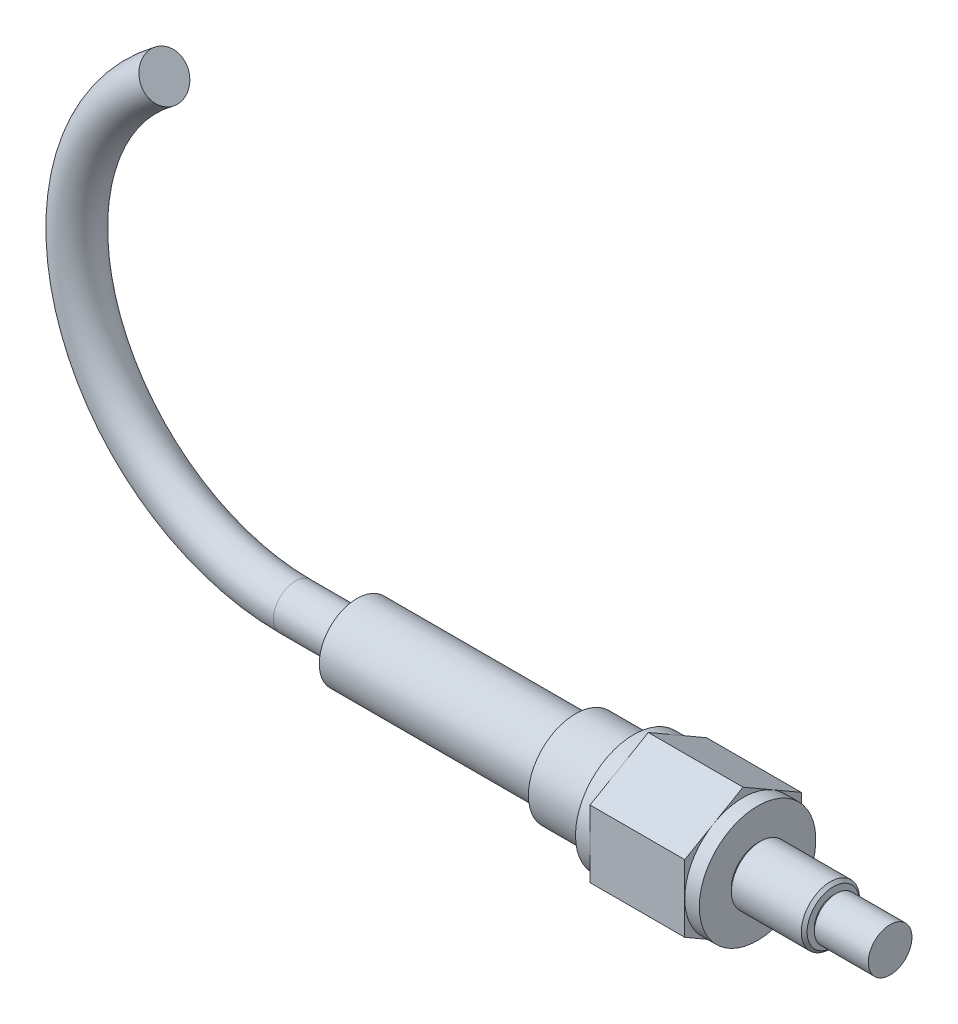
ISO-10303-21;
HEADER;
FILE_DESCRIPTION(('STEP AP214'),'2;1');
FILE_NAME('part.step','',(''),(''),'','','');
FILE_SCHEMA(('AUTOMOTIVE_DESIGN { 1 0 10303 214 1 1 1 1 }'));
ENDSEC;
DATA;
#1=APPLICATION_CONTEXT('core data for automotive mechanical design processes');
#2=APPLICATION_PROTOCOL_DEFINITION('international standard','automotive_design',2000,#1);
#3=PRODUCT_CONTEXT('',#1,'mechanical');
#4=PRODUCT('Part','Part','',(#3));
#5=PRODUCT_RELATED_PRODUCT_CATEGORY('part','',(#4));
#6=PRODUCT_DEFINITION_FORMATION('','',#4);
#7=PRODUCT_DEFINITION_CONTEXT('part definition',#1,'design');
#8=PRODUCT_DEFINITION('design','',#6,#7);
#9=PRODUCT_DEFINITION_SHAPE('','',#8);
#10=(LENGTH_UNIT() NAMED_UNIT(*) SI_UNIT(.MILLI.,.METRE.));
#11=(NAMED_UNIT(*) PLANE_ANGLE_UNIT() SI_UNIT($,.RADIAN.));
#12=(NAMED_UNIT(*) SI_UNIT($,.STERADIAN.) SOLID_ANGLE_UNIT());
#13=UNCERTAINTY_MEASURE_WITH_UNIT(LENGTH_MEASURE(1.E-05),#10,'distance_accuracy_value','');
#14=(GEOMETRIC_REPRESENTATION_CONTEXT(3) GLOBAL_UNCERTAINTY_ASSIGNED_CONTEXT((#13)) GLOBAL_UNIT_ASSIGNED_CONTEXT((#10,
#11,#12)) REPRESENTATION_CONTEXT('',''));
#15=CARTESIAN_POINT('',(0.,0.,0.));
#16=DIRECTION('',(0.,0.,1.));
#17=DIRECTION('',(1.,0.,0.));
#18=AXIS2_PLACEMENT_3D('',#15,#16,#17);
#19=CARTESIAN_POINT('',(-36.6,2.59029712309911,0.));
#20=DIRECTION('',(1.,0.,0.));
#21=DIRECTION('',(0.,0.,-1.));
#22=AXIS2_PLACEMENT_3D('',#19,#20,#21);
#23=PLANE('',#22);
#24=CARTESIAN_POINT('',(-36.6,0.,0.));
#25=DIRECTION('',(-1.,0.,0.));
#26=DIRECTION('',(0.,0.,1.));
#27=AXIS2_PLACEMENT_3D('',#24,#25,#26);
#28=CIRCLE('',#27,2.59029712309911);
#29=CARTESIAN_POINT('',(-36.6,0.,2.59029712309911));
#30=VERTEX_POINT('',#29);
#31=EDGE_CURVE('E68',#30,#30,#28,.T.);
#32=ORIENTED_EDGE('',*,*,#31,.T.);
#33=EDGE_LOOP('',(#32));
#34=FACE_BOUND('',#33,.T.);
#35=CARTESIAN_POINT('',(-36.6,0.,0.));
#36=DIRECTION('',(-1.,0.,0.));
#37=DIRECTION('',(0.,0.,1.));
#38=AXIS2_PLACEMENT_3D('',#35,#36,#37);
#39=CIRCLE('',#38,1.5);
#40=CARTESIAN_POINT('',(-36.6,0.,1.5));
#41=VERTEX_POINT('',#40);
#42=EDGE_CURVE('E11',#41,#41,#39,.T.);
#43=ORIENTED_EDGE('',*,*,#42,.F.);
#44=EDGE_LOOP('',(#43));
#45=FACE_BOUND('',#44,.T.);
#46=ADVANCED_FACE('F46',(#34,#45),#23,.F.);
#47=CARTESIAN_POINT('',(-16.6,0.,0.));
#48=DIRECTION('',(-1.,0.,0.));
#49=DIRECTION('',(0.,0.,1.));
#50=AXIS2_PLACEMENT_3D('',#47,#48,#49);
#51=PLANE('',#50);
#52=CARTESIAN_POINT('',(-16.6,0.,0.));
#53=DIRECTION('',(-1.,0.,0.));
#54=DIRECTION('',(0.,0.,1.));
#55=AXIS2_PLACEMENT_3D('',#52,#53,#54);
#56=CIRCLE('',#55,4.);
#57=CARTESIAN_POINT('',(-16.6,0.,4.));
#58=VERTEX_POINT('',#57);
#59=EDGE_CURVE('E50',#58,#58,#56,.T.);
#60=ORIENTED_EDGE('',*,*,#59,.F.);
#61=EDGE_LOOP('',(#60));
#62=FACE_BOUND('',#61,.T.);
#63=ADVANCED_FACE('F48',(#62),#51,.F.);
#64=CARTESIAN_POINT('',(0.,0.,0.));
#65=DIRECTION('',(-1.,0.,0.));
#66=DIRECTION('',(0.,0.,1.));
#67=AXIS2_PLACEMENT_3D('',#64,#65,#66);
#68=CYLINDRICAL_SURFACE('',#67,4.);
#69=CARTESIAN_POINT('',(-17.6,0.,0.));
#70=DIRECTION('',(-1.,0.,0.));
#71=DIRECTION('',(0.,0.,1.));
#72=AXIS2_PLACEMENT_3D('',#69,#70,#71);
#73=CIRCLE('',#72,4.);
#74=CARTESIAN_POINT('',(-17.6,0.,4.));
#75=VERTEX_POINT('',#74);
#76=EDGE_CURVE('E61',#75,#75,#73,.T.);
#77=ORIENTED_EDGE('',*,*,#76,.F.);
#78=EDGE_LOOP('',(#77));
#79=FACE_BOUND('',#78,.T.);
#80=ORIENTED_EDGE('',*,*,#59,.T.);
#81=EDGE_LOOP('',(#80));
#82=FACE_BOUND('',#81,.T.);
#83=ADVANCED_FACE('F89',(#79,#82),#68,.T.);
#84=CARTESIAN_POINT('',(-17.6,4.,0.));
#85=DIRECTION('',(1.,0.,0.));
#86=DIRECTION('',(0.,0.,-1.));
#87=AXIS2_PLACEMENT_3D('',#84,#85,#86);
#88=PLANE('',#87);
#89=CARTESIAN_POINT('',(-17.6,0.,0.));
#90=DIRECTION('',(-1.,0.,0.));
#91=DIRECTION('',(0.,0.,1.));
#92=AXIS2_PLACEMENT_3D('',#89,#90,#91);
#93=CIRCLE('',#92,3.23454467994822);
#94=CARTESIAN_POINT('',(-17.6,0.,3.23454467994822));
#95=VERTEX_POINT('',#94);
#96=EDGE_CURVE('E80',#95,#95,#93,.T.);
#97=ORIENTED_EDGE('',*,*,#96,.F.);
#98=EDGE_LOOP('',(#97));
#99=FACE_BOUND('',#98,.T.);
#100=ORIENTED_EDGE('',*,*,#76,.T.);
#101=EDGE_LOOP('',(#100));
#102=FACE_BOUND('',#101,.T.);
#103=ADVANCED_FACE('F87',(#99,#102),#88,.F.);
#104=CARTESIAN_POINT('',(0.,0.,0.));
#105=DIRECTION('',(-1.,0.,0.));
#106=DIRECTION('',(0.,0.,1.));
#107=AXIS2_PLACEMENT_3D('',#104,#105,#106);
#108=CYLINDRICAL_SURFACE('',#107,3.23454467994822);
#109=CARTESIAN_POINT('',(-21.6,0.,0.));
#110=DIRECTION('',(-1.,0.,0.));
#111=DIRECTION('',(0.,0.,1.));
#112=AXIS2_PLACEMENT_3D('',#109,#110,#111);
#113=CIRCLE('',#112,3.23454467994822);
#114=CARTESIAN_POINT('',(-21.6,0.,3.23454467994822));
#115=VERTEX_POINT('',#114);
#116=EDGE_CURVE('E76',#115,#115,#113,.T.);
#117=ORIENTED_EDGE('',*,*,#116,.F.);
#118=EDGE_LOOP('',(#117));
#119=FACE_BOUND('',#118,.T.);
#120=ORIENTED_EDGE('',*,*,#96,.T.);
#121=EDGE_LOOP('',(#120));
#122=FACE_BOUND('',#121,.T.);
#123=ADVANCED_FACE('F114',(#119,#122),#108,.T.);
#124=CARTESIAN_POINT('',(-21.6,3.23454467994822,0.));
#125=DIRECTION('',(1.,0.,0.));
#126=DIRECTION('',(0.,0.,-1.));
#127=AXIS2_PLACEMENT_3D('',#124,#125,#126);
#128=PLANE('',#127);
#129=CARTESIAN_POINT('',(-21.6,0.,0.));
#130=DIRECTION('',(-1.,0.,0.));
#131=DIRECTION('',(0.,0.,1.));
#132=AXIS2_PLACEMENT_3D('',#129,#130,#131);
#133=CIRCLE('',#132,2.59029712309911);
#134=CARTESIAN_POINT('',(-21.6,0.,2.59029712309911));
#135=VERTEX_POINT('',#134);
#136=EDGE_CURVE('E72',#135,#135,#133,.T.);
#137=ORIENTED_EDGE('',*,*,#136,.F.);
#138=EDGE_LOOP('',(#137));
#139=FACE_BOUND('',#138,.T.);
#140=ORIENTED_EDGE('',*,*,#116,.T.);
#141=EDGE_LOOP('',(#140));
#142=FACE_BOUND('',#141,.T.);
#143=ADVANCED_FACE('F110',(#139,#142),#128,.F.);
#144=CARTESIAN_POINT('',(0.,0.,0.));
#145=DIRECTION('',(-1.,0.,0.));
#146=DIRECTION('',(0.,0.,1.));
#147=AXIS2_PLACEMENT_3D('',#144,#145,#146);
#148=CYLINDRICAL_SURFACE('',#147,2.59029712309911);
#149=ORIENTED_EDGE('',*,*,#31,.F.);
#150=EDGE_LOOP('',(#149));
#151=FACE_BOUND('',#150,.T.);
#152=ORIENTED_EDGE('',*,*,#136,.T.);
#153=EDGE_LOOP('',(#152));
#154=FACE_BOUND('',#153,.T.);
#155=ADVANCED_FACE('F107',(#151,#154),#148,.T.);
#156=CARTESIAN_POINT('',(-40.838108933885,15.,0.));
#157=DIRECTION('',(0.,0.,-1.));
#158=DIRECTION('',(-1.,0.,0.));
#159=AXIS2_PLACEMENT_3D('',#156,#157,#158);
#160=TOROIDAL_SURFACE('',#159,15.,1.5);
#161=CARTESIAN_POINT('',(-40.838108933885,0.,0.));
#162=DIRECTION('',(-1.,0.,0.));
#163=DIRECTION('',(0.,0.,1.));
#164=AXIS2_PLACEMENT_3D('',#161,#162,#163);
#165=CIRCLE('',#164,1.5);
#166=CARTESIAN_POINT('',(-40.838108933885,-1.5,0.));
#167=VERTEX_POINT('',#166);
#168=EDGE_CURVE('E64',#167,#167,#165,.T.);
#169=CARTESIAN_POINT('',(-49.8226714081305,27.0115626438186,0.));
#170=DIRECTION('',(0.800770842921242,0.598970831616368,0.));
#171=DIRECTION('',(0.,0.,1.));
#172=AXIS2_PLACEMENT_3D('',#169,#170,#171);
#173=CIRCLE('',#172,1.5);
#174=CARTESIAN_POINT('',(-50.7211276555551,28.2127189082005,0.));
#175=VERTEX_POINT('',#174);
#176=EDGE_CURVE('E65',#175,#175,#173,.T.);
#177=CARTESIAN_POINT('',(-40.838108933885,15.,0.));
#178=DIRECTION('',(0.,0.,-1.));
#179=DIRECTION('',(-1.,0.,0.));
#180=AXIS2_PLACEMENT_3D('',#177,#178,#179);
#181=CIRCLE('',#180,16.5);
#182=EDGE_CURVE('',#167,#175,#181,.T.);
#183=ORIENTED_EDGE('',*,*,#168,.T.);
#184=ORIENTED_EDGE('',*,*,#176,.F.);
#185=ORIENTED_EDGE('',*,*,#182,.T.);
#186=ORIENTED_EDGE('',*,*,#182,.F.);
#187=EDGE_LOOP('',(#183,#185,#184,#186));
#188=FACE_BOUND('',#187,.T.);
#189=ADVANCED_FACE('F105',(#188),#160,.T.);
#190=CARTESIAN_POINT('',(-40.838108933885,0.,0.));
#191=DIRECTION('',(1.,0.,0.));
#192=DIRECTION('',(0.,0.,-1.));
#193=AXIS2_PLACEMENT_3D('',#190,#191,#192);
#194=CYLINDRICAL_SURFACE('',#193,1.5);
#195=ORIENTED_EDGE('',*,*,#168,.F.);
#196=EDGE_LOOP('',(#195));
#197=FACE_BOUND('',#196,.T.);
#198=ORIENTED_EDGE('',*,*,#42,.T.);
#199=EDGE_LOOP('',(#198));
#200=FACE_BOUND('',#199,.T.);
#201=ADVANCED_FACE('F141',(#197,#200),#194,.T.);
#202=CARTESIAN_POINT('',(-49.8226714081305,27.0115626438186,0.));
#203=DIRECTION('',(0.800770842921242,0.598970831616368,0.));
#204=DIRECTION('',(0.,0.,1.));
#205=AXIS2_PLACEMENT_3D('',#202,#203,#204);
#206=PLANE('',#205);
#207=ORIENTED_EDGE('',*,*,#176,.T.);
#208=EDGE_LOOP('',(#207));
#209=FACE_BOUND('',#208,.T.);
#210=ADVANCED_FACE('F147',(#209),#206,.T.);
#211=CLOSED_SHELL('',(#46,#63,#83,#103,#123,#143,#155,#189,#201,#210));
#212=MANIFOLD_SOLID_BREP('B2',#211);
#213=CARTESIAN_POINT('',(0.,0.,0.));
#214=DIRECTION('',(-1.,0.,0.));
#215=DIRECTION('',(0.,0.,1.));
#216=AXIS2_PLACEMENT_3D('',#213,#214,#215);
#217=PLANE('',#216);
#218=CARTESIAN_POINT('',(0.,0.,0.));
#219=DIRECTION('',(-1.,0.,0.));
#220=DIRECTION('',(0.,0.,1.));
#221=AXIS2_PLACEMENT_3D('',#218,#219,#220);
#222=CIRCLE('',#221,1.5);
#223=CARTESIAN_POINT('',(0.,0.,1.5));
#224=VERTEX_POINT('',#223);
#225=EDGE_CURVE('E44',#224,#224,#222,.T.);
#226=ORIENTED_EDGE('',*,*,#225,.F.);
#227=EDGE_LOOP('',(#226));
#228=FACE_BOUND('',#227,.T.);
#229=ADVANCED_FACE('F210',(#228),#217,.F.);
#230=CARTESIAN_POINT('',(0.,0.,0.));
#231=DIRECTION('',(-1.,0.,0.));
#232=DIRECTION('',(0.,0.,1.));
#233=AXIS2_PLACEMENT_3D('',#230,#231,#232);
#234=CYLINDRICAL_SURFACE('',#233,1.5);
#235=CARTESIAN_POINT('',(-3.7,0.,0.));
#236=DIRECTION('',(-1.,0.,0.));
#237=DIRECTION('',(0.,0.,1.));
#238=AXIS2_PLACEMENT_3D('',#235,#236,#237);
#239=CIRCLE('',#238,1.5);
#240=CARTESIAN_POINT('',(-3.7,0.,1.5));
#241=VERTEX_POINT('',#240);
#242=EDGE_CURVE('E218',#241,#241,#239,.T.);
#243=ORIENTED_EDGE('',*,*,#242,.F.);
#244=EDGE_LOOP('',(#243));
#245=FACE_BOUND('',#244,.T.);
#246=ORIENTED_EDGE('',*,*,#225,.T.);
#247=EDGE_LOOP('',(#246));
#248=FACE_BOUND('',#247,.T.);
#249=ADVANCED_FACE('F391',(#245,#248),#234,.T.);
#250=CARTESIAN_POINT('',(-3.7,1.5,0.));
#251=DIRECTION('',(1.,0.,0.));
#252=DIRECTION('',(0.,0.,-1.));
#253=AXIS2_PLACEMENT_3D('',#250,#251,#252);
#254=PLANE('',#253);
#255=CARTESIAN_POINT('',(-3.7,0.,0.));
#256=DIRECTION('',(-1.,0.,0.));
#257=DIRECTION('',(0.,0.,1.));
#258=AXIS2_PLACEMENT_3D('',#255,#256,#257);
#259=CIRCLE('',#258,1.3);
#260=CARTESIAN_POINT('',(-3.7,0.,1.3));
#261=VERTEX_POINT('',#260);
#262=EDGE_CURVE('E382',#261,#261,#259,.T.);
#263=ORIENTED_EDGE('',*,*,#262,.F.);
#264=EDGE_LOOP('',(#263));
#265=FACE_BOUND('',#264,.T.);
#266=ORIENTED_EDGE('',*,*,#242,.T.);
#267=EDGE_LOOP('',(#266));
#268=FACE_BOUND('',#267,.T.);
#269=ADVANCED_FACE('F389',(#265,#268),#254,.F.);
#270=CARTESIAN_POINT('',(0.,0.,0.));
#271=DIRECTION('',(-1.,0.,0.));
#272=DIRECTION('',(0.,0.,1.));
#273=AXIS2_PLACEMENT_3D('',#270,#271,#272);
#274=CYLINDRICAL_SURFACE('',#273,1.3);
#275=CARTESIAN_POINT('',(-3.9,0.,0.));
#276=DIRECTION('',(-1.,0.,0.));
#277=DIRECTION('',(0.,0.,1.));
#278=AXIS2_PLACEMENT_3D('',#275,#276,#277);
#279=CIRCLE('',#278,1.3);
#280=CARTESIAN_POINT('',(-3.9,0.,1.3));
#281=VERTEX_POINT('',#280);
#282=EDGE_CURVE('E378',#281,#281,#279,.T.);
#283=ORIENTED_EDGE('',*,*,#282,.F.);
#284=EDGE_LOOP('',(#283));
#285=FACE_BOUND('',#284,.T.);
#286=ORIENTED_EDGE('',*,*,#262,.T.);
#287=EDGE_LOOP('',(#286));
#288=FACE_BOUND('',#287,.T.);
#289=ADVANCED_FACE('F407',(#285,#288),#274,.T.);
#290=CARTESIAN_POINT('',(-3.9,1.3,0.));
#291=DIRECTION('',(-1.,0.,0.));
#292=DIRECTION('',(0.,0.,1.));
#293=AXIS2_PLACEMENT_3D('',#290,#291,#292);
#294=PLANE('',#293);
#295=CARTESIAN_POINT('',(-3.9,0.,0.));
#296=DIRECTION('',(-1.,0.,0.));
#297=DIRECTION('',(0.,0.,1.));
#298=AXIS2_PLACEMENT_3D('',#295,#296,#297);
#299=CIRCLE('',#298,1.8);
#300=CARTESIAN_POINT('',(-3.9,0.,1.8));
#301=VERTEX_POINT('',#300);
#302=EDGE_CURVE('E374',#301,#301,#299,.T.);
#303=ORIENTED_EDGE('',*,*,#302,.F.);
#304=EDGE_LOOP('',(#303));
#305=FACE_BOUND('',#304,.T.);
#306=ORIENTED_EDGE('',*,*,#282,.T.);
#307=EDGE_LOOP('',(#306));
#308=FACE_BOUND('',#307,.T.);
#309=ADVANCED_FACE('F414',(#305,#308),#294,.F.);
#310=CARTESIAN_POINT('',(-3.9,0.,0.));
#311=DIRECTION('',(-1.,0.,0.));
#312=DIRECTION('',(0.,0.,1.));
#313=AXIS2_PLACEMENT_3D('',#310,#311,#312);
#314=CONICAL_SURFACE('',#313,1.8,0.785398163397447);
#315=CARTESIAN_POINT('',(-4.1,0.,0.));
#316=DIRECTION('',(-1.,0.,0.));
#317=DIRECTION('',(0.,0.,1.));
#318=AXIS2_PLACEMENT_3D('',#315,#316,#317);
#319=CIRCLE('',#318,2.);
#320=CARTESIAN_POINT('',(-4.1,0.,2.));
#321=VERTEX_POINT('',#320);
#322=EDGE_CURVE('E370',#321,#321,#319,.T.);
#323=ORIENTED_EDGE('',*,*,#322,.F.);
#324=EDGE_LOOP('',(#323));
#325=FACE_BOUND('',#324,.T.);
#326=ORIENTED_EDGE('',*,*,#302,.T.);
#327=EDGE_LOOP('',(#326));
#328=FACE_BOUND('',#327,.T.);
#329=ADVANCED_FACE('F421',(#325,#328),#314,.T.);
#330=CARTESIAN_POINT('',(0.,0.,0.));
#331=DIRECTION('',(-1.,0.,0.));
#332=DIRECTION('',(0.,0.,1.));
#333=AXIS2_PLACEMENT_3D('',#330,#331,#332);
#334=CYLINDRICAL_SURFACE('',#333,2.);
#335=CARTESIAN_POINT('',(-8.9,0.,0.));
#336=DIRECTION('',(-1.,0.,0.));
#337=DIRECTION('',(0.,0.,1.));
#338=AXIS2_PLACEMENT_3D('',#335,#336,#337);
#339=CIRCLE('',#338,2.);
#340=CARTESIAN_POINT('',(-8.9,0.,2.));
#341=VERTEX_POINT('',#340);
#342=EDGE_CURVE('E366',#341,#341,#339,.T.);
#343=ORIENTED_EDGE('',*,*,#342,.F.);
#344=EDGE_LOOP('',(#343));
#345=FACE_BOUND('',#344,.T.);
#346=ORIENTED_EDGE('',*,*,#322,.T.);
#347=EDGE_LOOP('',(#346));
#348=FACE_BOUND('',#347,.T.);
#349=ADVANCED_FACE('F428',(#345,#348),#334,.T.);
#350=CARTESIAN_POINT('',(-8.9,0.,0.));
#351=DIRECTION('',(1.,0.,0.));
#352=DIRECTION('',(0.,0.,-1.));
#353=AXIS2_PLACEMENT_3D('',#350,#351,#352);
#354=CONICAL_SURFACE('',#353,2.,0.785398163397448);
#355=CARTESIAN_POINT('',(-9.1,0.,0.));
#356=DIRECTION('',(-1.,0.,0.));
#357=DIRECTION('',(0.,0.,1.));
#358=AXIS2_PLACEMENT_3D('',#355,#356,#357);
#359=CIRCLE('',#358,1.8);
#360=CARTESIAN_POINT('',(-9.1,0.,1.8));
#361=VERTEX_POINT('',#360);
#362=EDGE_CURVE('E362',#361,#361,#359,.T.);
#363=ORIENTED_EDGE('',*,*,#362,.F.);
#364=EDGE_LOOP('',(#363));
#365=FACE_BOUND('',#364,.T.);
#366=ORIENTED_EDGE('',*,*,#342,.T.);
#367=EDGE_LOOP('',(#366));
#368=FACE_BOUND('',#367,.T.);
#369=ADVANCED_FACE('F435',(#365,#368),#354,.T.);
#370=CARTESIAN_POINT('',(-9.1,1.8,0.));
#371=DIRECTION('',(-1.,0.,0.));
#372=DIRECTION('',(0.,0.,1.));
#373=AXIS2_PLACEMENT_3D('',#370,#371,#372);
#374=PLANE('',#373);
#375=CARTESIAN_POINT('',(-9.1,0.,0.));
#376=DIRECTION('',(-1.,0.,0.));
#377=DIRECTION('',(0.,0.,1.));
#378=AXIS2_PLACEMENT_3D('',#375,#376,#377);
#379=CIRCLE('',#378,4.);
#380=CARTESIAN_POINT('',(-9.1,0.,4.));
#381=VERTEX_POINT('',#380);
#382=EDGE_CURVE('E357',#381,#381,#379,.T.);
#383=ORIENTED_EDGE('',*,*,#382,.F.);
#384=EDGE_LOOP('',(#383));
#385=FACE_BOUND('',#384,.T.);
#386=ORIENTED_EDGE('',*,*,#362,.T.);
#387=EDGE_LOOP('',(#386));
#388=FACE_BOUND('',#387,.T.);
#389=ADVANCED_FACE('F442',(#385,#388),#374,.F.);
#390=CARTESIAN_POINT('',(0.,0.,0.));
#391=DIRECTION('',(-1.,0.,0.));
#392=DIRECTION('',(0.,0.,1.));
#393=AXIS2_PLACEMENT_3D('',#390,#391,#392);
#394=CYLINDRICAL_SURFACE('',#393,4.);
#395=CARTESIAN_POINT('',(-10.1,0.,0.));
#396=DIRECTION('',(-1.,0.,0.));
#397=DIRECTION('',(0.,0.,1.));
#398=AXIS2_PLACEMENT_3D('',#395,#396,#397);
#399=CIRCLE('',#398,4.);
#400=CARTESIAN_POINT('',(-10.1,0.,4.));
#401=VERTEX_POINT('',#400);
#402=CARTESIAN_POINT('',(-10.1,3.46410161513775,2.));
#403=VERTEX_POINT('',#402);
#404=EDGE_CURVE('E316',#401,#403,#399,.T.);
#405=ORIENTED_EDGE('',*,*,#404,.F.);
#406=CARTESIAN_POINT('',(-10.1,-3.46410161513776,2.));
#407=VERTEX_POINT('',#406);
#408=EDGE_CURVE('E225',#407,#401,#399,.T.);
#409=ORIENTED_EDGE('',*,*,#408,.F.);
#410=CARTESIAN_POINT('',(-10.1,-3.46410161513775,-2.));
#411=VERTEX_POINT('',#410);
#412=EDGE_CURVE('E229',#411,#407,#399,.T.);
#413=ORIENTED_EDGE('',*,*,#412,.F.);
#414=CARTESIAN_POINT('',(-10.1,0.,-4.));
#415=VERTEX_POINT('',#414);
#416=EDGE_CURVE('E652',#415,#411,#399,.T.);
#417=ORIENTED_EDGE('',*,*,#416,.F.);
#418=CARTESIAN_POINT('',(-10.1,3.46410161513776,-2.));
#419=VERTEX_POINT('',#418);
#420=EDGE_CURVE('E649',#419,#415,#399,.T.);
#421=ORIENTED_EDGE('',*,*,#420,.F.);
#422=EDGE_CURVE('E358',#403,#419,#399,.T.);
#423=ORIENTED_EDGE('',*,*,#422,.F.);
#424=EDGE_LOOP('',(#405,#409,#413,#417,#421,#423));
#425=FACE_BOUND('',#424,.T.);
#426=ORIENTED_EDGE('',*,*,#382,.T.);
#427=EDGE_LOOP('',(#426));
#428=FACE_BOUND('',#427,.T.);
#429=ADVANCED_FACE('F449',(#425,#428),#394,.T.);
#430=CARTESIAN_POINT('',(-10.1,0.,0.));
#431=DIRECTION('',(-1.,0.,0.));
#432=DIRECTION('',(0.,0.,1.));
#433=AXIS2_PLACEMENT_3D('',#430,#431,#432);
#434=PLANE('',#433);
#435=DIRECTION('',(0.,1.,0.));
#436=VECTOR('',#435,1.);
#437=CARTESIAN_POINT('',(-10.1,-2.3094010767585,4.));
#438=LINE('',#437,#436);
#439=CARTESIAN_POINT('',(-10.1,2.3094010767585,4.));
#440=VERTEX_POINT('',#439);
#441=EDGE_CURVE('E292',#401,#440,#438,.T.);
#442=ORIENTED_EDGE('',*,*,#441,.F.);
#443=ORIENTED_EDGE('',*,*,#404,.T.);
#444=DIRECTION('',(0.,0.5,-0.866025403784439));
#445=VECTOR('',#444,1.);
#446=CARTESIAN_POINT('',(-10.1,2.3094010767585,4.));
#447=LINE('',#446,#445);
#448=EDGE_CURVE('E321',#440,#403,#447,.T.);
#449=ORIENTED_EDGE('',*,*,#448,.F.);
#450=EDGE_LOOP('',(#442,#443,#449));
#451=FACE_BOUND('',#450,.T.);
#452=ADVANCED_FACE('F456',(#451),#434,.F.);
#453=CARTESIAN_POINT('',(-10.1,4.61880215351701,0.));
#454=VERTEX_POINT('',#453);
#455=EDGE_CURVE('E353',#403,#454,#447,.T.);
#456=ORIENTED_EDGE('',*,*,#455,.F.);
#457=ORIENTED_EDGE('',*,*,#422,.T.);
#458=DIRECTION('',(0.,-0.5,-0.866025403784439));
#459=VECTOR('',#458,1.);
#460=CARTESIAN_POINT('',(-10.1,4.61880215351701,0.));
#461=LINE('',#460,#459);
#462=EDGE_CURVE('E342',#454,#419,#461,.T.);
#463=ORIENTED_EDGE('',*,*,#462,.F.);
#464=EDGE_LOOP('',(#456,#457,#463));
#465=FACE_BOUND('',#464,.T.);
#466=ADVANCED_FACE('F462',(#465),#434,.F.);
#467=CARTESIAN_POINT('',(-10.1,2.3094010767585,-4.));
#468=VERTEX_POINT('',#467);
#469=EDGE_CURVE('E336',#419,#468,#461,.T.);
#470=ORIENTED_EDGE('',*,*,#469,.F.);
#471=ORIENTED_EDGE('',*,*,#420,.T.);
#472=DIRECTION('',(0.,-1.,0.));
#473=VECTOR('',#472,1.);
#474=CARTESIAN_POINT('',(-10.1,2.3094010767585,-4.));
#475=LINE('',#474,#473);
#476=EDGE_CURVE('E348',#468,#415,#475,.T.);
#477=ORIENTED_EDGE('',*,*,#476,.F.);
#478=EDGE_LOOP('',(#470,#471,#477));
#479=FACE_BOUND('',#478,.T.);
#480=ADVANCED_FACE('F470',(#479),#434,.F.);
#481=CARTESIAN_POINT('',(-10.1,-2.3094010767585,-4.));
#482=VERTEX_POINT('',#481);
#483=EDGE_CURVE('E341',#415,#482,#475,.T.);
#484=ORIENTED_EDGE('',*,*,#483,.F.);
#485=ORIENTED_EDGE('',*,*,#416,.T.);
#486=DIRECTION('',(0.,-0.5,0.866025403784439));
#487=VECTOR('',#486,1.);
#488=CARTESIAN_POINT('',(-10.1,-2.3094010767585,-4.));
#489=LINE('',#488,#487);
#490=EDGE_CURVE('E350',#482,#411,#489,.T.);
#491=ORIENTED_EDGE('',*,*,#490,.F.);
#492=EDGE_LOOP('',(#484,#485,#491));
#493=FACE_BOUND('',#492,.T.);
#494=ADVANCED_FACE('F476',(#493),#434,.F.);
#495=CARTESIAN_POINT('',(-10.1,-4.61880215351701,0.));
#496=VERTEX_POINT('',#495);
#497=EDGE_CURVE('E347',#411,#496,#489,.T.);
#498=ORIENTED_EDGE('',*,*,#497,.F.);
#499=ORIENTED_EDGE('',*,*,#412,.T.);
#500=DIRECTION('',(0.,0.5,0.866025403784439));
#501=VECTOR('',#500,1.);
#502=CARTESIAN_POINT('',(-10.1,-4.61880215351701,0.));
#503=LINE('',#502,#501);
#504=EDGE_CURVE('E293',#496,#407,#503,.T.);
#505=ORIENTED_EDGE('',*,*,#504,.F.);
#506=EDGE_LOOP('',(#498,#499,#505));
#507=FACE_BOUND('',#506,.T.);
#508=ADVANCED_FACE('F482',(#507),#434,.F.);
#509=CARTESIAN_POINT('',(-10.1,-2.3094010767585,4.));
#510=VERTEX_POINT('',#509);
#511=EDGE_CURVE('E287',#407,#510,#503,.T.);
#512=ORIENTED_EDGE('',*,*,#511,.F.);
#513=ORIENTED_EDGE('',*,*,#408,.T.);
#514=EDGE_CURVE('E305',#510,#401,#438,.T.);
#515=ORIENTED_EDGE('',*,*,#514,.F.);
#516=EDGE_LOOP('',(#512,#513,#515));
#517=FACE_BOUND('',#516,.T.);
#518=ADVANCED_FACE('F465',(#517),#434,.F.);
#519=CARTESIAN_POINT('',(-28.8202018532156,2.3094010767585,4.));
#520=DIRECTION('',(0.,-0.866025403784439,-0.5));
#521=DIRECTION('',(0.,0.5,-0.866025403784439));
#522=AXIS2_PLACEMENT_3D('',#519,#520,#521);
#523=PLANE('',#522);
#524=DIRECTION('',(0.,0.5,-0.866025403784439));
#525=VECTOR('',#524,1.);
#526=CARTESIAN_POINT('',(-16.6,2.3094010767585,4.));
#527=LINE('',#526,#525);
#528=CARTESIAN_POINT('',(-16.6,2.3094010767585,4.));
#529=VERTEX_POINT('',#528);
#530=CARTESIAN_POINT('',(-16.6,4.61880215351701,0.));
#531=VERTEX_POINT('',#530);
#532=EDGE_CURVE('E304',#529,#531,#527,.T.);
#533=ORIENTED_EDGE('',*,*,#532,.F.);
#534=DIRECTION('',(1.,0.,0.));
#535=VECTOR('',#534,1.);
#536=CARTESIAN_POINT('',(-28.8202018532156,2.3094010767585,4.));
#537=LINE('',#536,#535);
#538=EDGE_CURVE('E299',#529,#440,#537,.T.);
#539=ORIENTED_EDGE('',*,*,#538,.T.);
#540=ORIENTED_EDGE('',*,*,#448,.T.);
#541=ORIENTED_EDGE('',*,*,#455,.T.);
#542=DIRECTION('',(1.,0.,0.));
#543=VECTOR('',#542,1.);
#544=CARTESIAN_POINT('',(-28.8202018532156,4.61880215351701,0.));
#545=LINE('',#544,#543);
#546=EDGE_CURVE('E332',#531,#454,#545,.T.);
#547=ORIENTED_EDGE('',*,*,#546,.F.);
#548=EDGE_LOOP('',(#533,#539,#540,#541,#547));
#549=FACE_BOUND('',#548,.T.);
#550=ADVANCED_FACE('F493',(#549),#523,.F.);
#551=CARTESIAN_POINT('',(-28.8202018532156,4.61880215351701,0.));
#552=DIRECTION('',(0.,-0.866025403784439,0.5));
#553=DIRECTION('',(0.,-0.5,-0.866025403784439));
#554=AXIS2_PLACEMENT_3D('',#551,#552,#553);
#555=PLANE('',#554);
#556=DIRECTION('',(0.,-0.5,-0.866025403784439));
#557=VECTOR('',#556,1.);
#558=CARTESIAN_POINT('',(-16.6,4.61880215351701,0.));
#559=LINE('',#558,#557);
#560=CARTESIAN_POINT('',(-16.6,2.3094010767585,-4.));
#561=VERTEX_POINT('',#560);
#562=EDGE_CURVE('E326',#531,#561,#559,.T.);
#563=ORIENTED_EDGE('',*,*,#562,.F.);
#564=ORIENTED_EDGE('',*,*,#546,.T.);
#565=ORIENTED_EDGE('',*,*,#462,.T.);
#566=ORIENTED_EDGE('',*,*,#469,.T.);
#567=DIRECTION('',(1.,0.,0.));
#568=VECTOR('',#567,1.);
#569=CARTESIAN_POINT('',(-28.8202018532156,2.3094010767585,-4.));
#570=LINE('',#569,#568);
#571=EDGE_CURVE('E337',#561,#468,#570,.T.);
#572=ORIENTED_EDGE('',*,*,#571,.F.);
#573=EDGE_LOOP('',(#563,#564,#565,#566,#572));
#574=FACE_BOUND('',#573,.T.);
#575=ADVANCED_FACE('F499',(#574),#555,.F.);
#576=CARTESIAN_POINT('',(-28.8202018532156,2.3094010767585,-4.));
#577=DIRECTION('',(0.,0.,1.));
#578=DIRECTION('',(0.,-1.,0.));
#579=AXIS2_PLACEMENT_3D('',#576,#577,#578);
#580=PLANE('',#579);
#581=DIRECTION('',(0.,-1.,0.));
#582=VECTOR('',#581,1.);
#583=CARTESIAN_POINT('',(-16.6,2.3094010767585,-4.));
#584=LINE('',#583,#582);
#585=CARTESIAN_POINT('',(-16.6,-2.3094010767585,-4.));
#586=VERTEX_POINT('',#585);
#587=EDGE_CURVE('E318',#561,#586,#584,.T.);
#588=ORIENTED_EDGE('',*,*,#587,.F.);
#589=ORIENTED_EDGE('',*,*,#571,.T.);
#590=ORIENTED_EDGE('',*,*,#476,.T.);
#591=ORIENTED_EDGE('',*,*,#483,.T.);
#592=DIRECTION('',(1.,0.,0.));
#593=VECTOR('',#592,1.);
#594=CARTESIAN_POINT('',(-28.8202018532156,-2.3094010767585,-4.));
#595=LINE('',#594,#593);
#596=EDGE_CURVE('E343',#586,#482,#595,.T.);
#597=ORIENTED_EDGE('',*,*,#596,.F.);
#598=EDGE_LOOP('',(#588,#589,#590,#591,#597));
#599=FACE_BOUND('',#598,.T.);
#600=ADVANCED_FACE('F506',(#599),#580,.F.);
#601=CARTESIAN_POINT('',(-28.8202018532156,-2.3094010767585,-4.));
#602=DIRECTION('',(0.,0.866025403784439,0.5));
#603=DIRECTION('',(0.,-0.5,0.866025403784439));
#604=AXIS2_PLACEMENT_3D('',#601,#602,#603);
#605=PLANE('',#604);
#606=DIRECTION('',(0.,-0.5,0.866025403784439));
#607=VECTOR('',#606,1.);
#608=CARTESIAN_POINT('',(-16.6,-2.3094010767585,-4.));
#609=LINE('',#608,#607);
#610=CARTESIAN_POINT('',(-16.6,-4.61880215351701,0.));
#611=VERTEX_POINT('',#610);
#612=EDGE_CURVE('E310',#586,#611,#609,.T.);
#613=ORIENTED_EDGE('',*,*,#612,.F.);
#614=ORIENTED_EDGE('',*,*,#596,.T.);
#615=ORIENTED_EDGE('',*,*,#490,.T.);
#616=ORIENTED_EDGE('',*,*,#497,.T.);
#617=DIRECTION('',(1.,0.,0.));
#618=VECTOR('',#617,1.);
#619=CARTESIAN_POINT('',(-28.8202018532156,-4.61880215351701,0.));
#620=LINE('',#619,#618);
#621=EDGE_CURVE('E349',#611,#496,#620,.T.);
#622=ORIENTED_EDGE('',*,*,#621,.F.);
#623=EDGE_LOOP('',(#613,#614,#615,#616,#622));
#624=FACE_BOUND('',#623,.T.);
#625=ADVANCED_FACE('F513',(#624),#605,.F.);
#626=CARTESIAN_POINT('',(-28.8202018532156,-4.61880215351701,0.));
#627=DIRECTION('',(0.,0.866025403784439,-0.5));
#628=DIRECTION('',(0.,0.5,0.866025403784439));
#629=AXIS2_PLACEMENT_3D('',#626,#627,#628);
#630=PLANE('',#629);
#631=DIRECTION('',(0.,0.5,0.866025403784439));
#632=VECTOR('',#631,1.);
#633=CARTESIAN_POINT('',(-16.6,-4.61880215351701,0.));
#634=LINE('',#633,#632);
#635=CARTESIAN_POINT('',(-16.6,-2.3094010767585,4.));
#636=VERTEX_POINT('',#635);
#637=EDGE_CURVE('E283',#611,#636,#634,.T.);
#638=ORIENTED_EDGE('',*,*,#637,.F.);
#639=ORIENTED_EDGE('',*,*,#621,.T.);
#640=ORIENTED_EDGE('',*,*,#504,.T.);
#641=ORIENTED_EDGE('',*,*,#511,.T.);
#642=DIRECTION('',(1.,0.,0.));
#643=VECTOR('',#642,1.);
#644=CARTESIAN_POINT('',(-28.8202018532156,-2.3094010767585,4.));
#645=LINE('',#644,#643);
#646=EDGE_CURVE('E278',#636,#510,#645,.T.);
#647=ORIENTED_EDGE('',*,*,#646,.F.);
#648=EDGE_LOOP('',(#638,#639,#640,#641,#647));
#649=FACE_BOUND('',#648,.T.);
#650=ADVANCED_FACE('F280',(#649),#630,.F.);
#651=CARTESIAN_POINT('',(-28.8202018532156,-2.3094010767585,4.));
#652=DIRECTION('',(0.,0.,-1.));
#653=DIRECTION('',(-1.,0.,0.));
#654=AXIS2_PLACEMENT_3D('',#651,#652,#653);
#655=PLANE('',#654);
#656=DIRECTION('',(0.,1.,0.));
#657=VECTOR('',#656,1.);
#658=CARTESIAN_POINT('',(-16.6,-2.3094010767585,4.));
#659=LINE('',#658,#657);
#660=EDGE_CURVE('E296',#636,#529,#659,.T.);
#661=ORIENTED_EDGE('',*,*,#660,.F.);
#662=ORIENTED_EDGE('',*,*,#646,.T.);
#663=ORIENTED_EDGE('',*,*,#514,.T.);
#664=ORIENTED_EDGE('',*,*,#441,.T.);
#665=ORIENTED_EDGE('',*,*,#538,.F.);
#666=EDGE_LOOP('',(#661,#662,#663,#664,#665));
#667=FACE_BOUND('',#666,.T.);
#668=ADVANCED_FACE('F297',(#667),#655,.F.);
#669=CARTESIAN_POINT('',(-16.6,0.,0.));
#670=DIRECTION('',(-1.,0.,0.));
#671=DIRECTION('',(0.,0.,1.));
#672=AXIS2_PLACEMENT_3D('',#669,#670,#671);
#673=PLANE('',#672);
#674=ORIENTED_EDGE('',*,*,#660,.T.);
#675=ORIENTED_EDGE('',*,*,#532,.T.);
#676=ORIENTED_EDGE('',*,*,#562,.T.);
#677=ORIENTED_EDGE('',*,*,#587,.T.);
#678=ORIENTED_EDGE('',*,*,#612,.T.);
#679=ORIENTED_EDGE('',*,*,#637,.T.);
#680=EDGE_LOOP('',(#674,#675,#676,#677,#678,#679));
#681=FACE_BOUND('',#680,.T.);
#682=ADVANCED_FACE('F308',(#681),#673,.T.);
#683=CLOSED_SHELL('',(#229,#249,#269,#289,#309,#329,#349,#369,#389,#429,#452,#466,#480,#494,
#508,#518,#550,#575,#600,#625,#650,#668,#682));
#684=MANIFOLD_SOLID_BREP('B6',#683);
#685=ADVANCED_BREP_SHAPE_REPRESENTATION('',(#18,#212,#684),#14);
#686=SHAPE_DEFINITION_REPRESENTATION(#9,#685);
ENDSEC;
END-ISO-10303-21;
